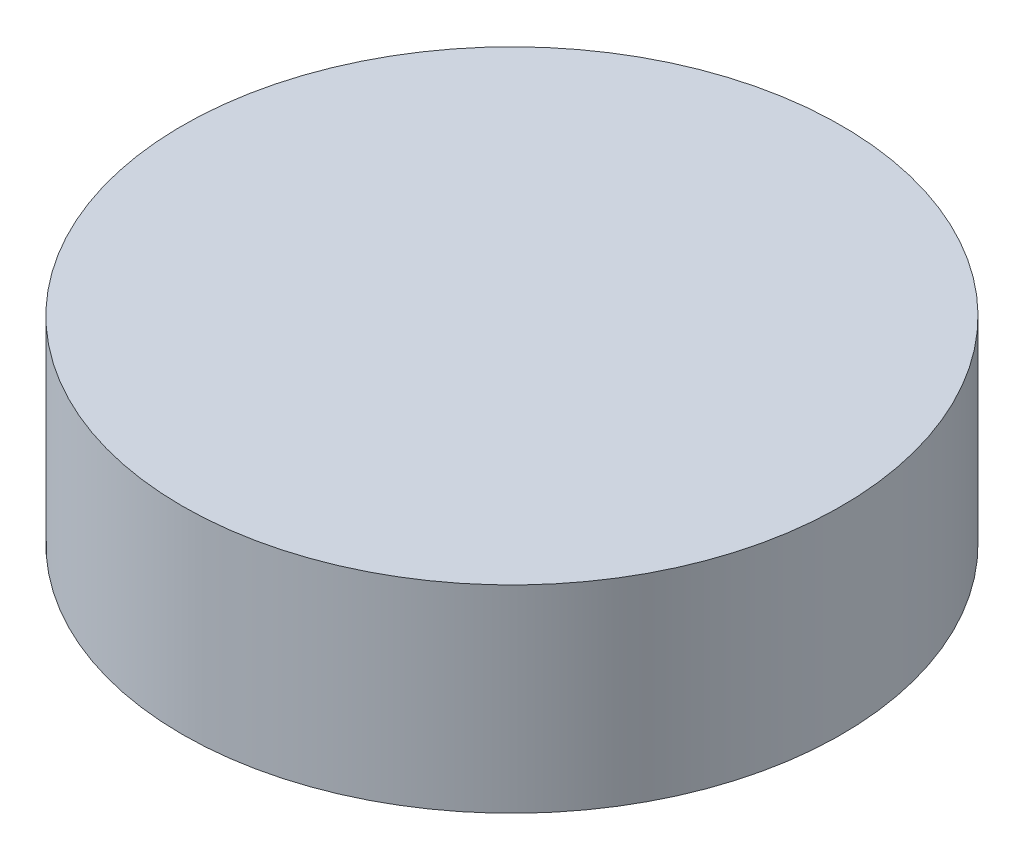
from build123d import *

# Parameters (mm, degrees)
SKETCH_1_R      = 5
EXTRUDE_1_DEPTH = 3


with BuildPart() as part:
    # Sketch 1 → Extrude 1 (new body)
    with BuildSketch(Plane(origin=(0, 0, 0), x_dir=(1, 0, 0), z_dir=(0, 1, 0))):
        with Locations(Location((0, 0, 0), (0, 0, 270))):
            Circle(SKETCH_1_R)
    extrude(amount=EXTRUDE_1_DEPTH)


solid = part.part
